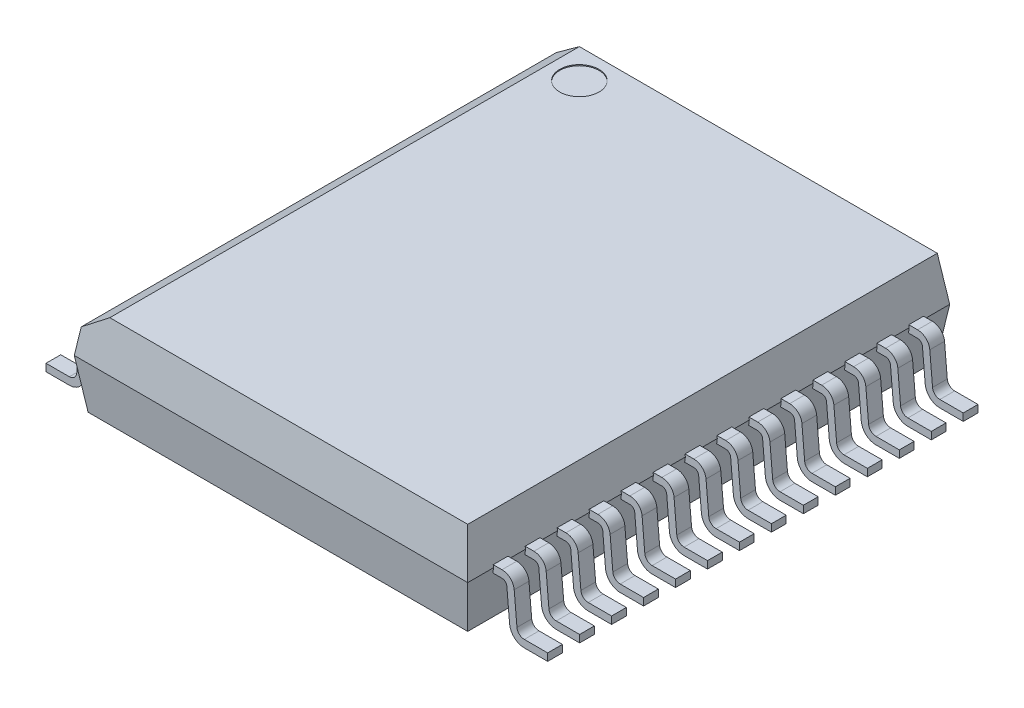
from build123d import *

# Parameters (mm, degrees)
EXTRUDE_1_DEPTH              = 0.15
SKETCH_9815_W                = 8
SKETCH_9815_H                = 9.8
EXTRUDE_9873_DEPTH           = 0.9
EXTRUDE_9873_TAPER           = 8
EXTRUDE_9873_OTHER_WAY_DEPTH = 1
EXTRUDE_9873_OTHER_WAY_TAPER = 8
PATTERN_LINEAR_9952_COUNT    = 14
PATTERN_LINEAR_9952_PITCH    = 0.65
CHAMFER_1_SIZE               = 0.4
CHAMFER_1_SIZE2              = 0.469982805
SKETCH_3_R                   = 0.4
CUT_EXTRUDE_3_DEPTH          = 0.02


with BuildPart() as part:
    # Sketch 1 → Extrude 1 (new, symmetric)
    with BuildSketch(Plane.XY.offset(-4.225)):
        with BuildLine():
            Line((-5.1, 0), (-4.624899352, 0))
            ThreePointArc((-4.624899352, 0), (-4.42222229, 0.078816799), (-4.326040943, 0.273853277))
            Line((-4.326040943, 0.273853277), (-4.270497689, 0.908715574))
            ThreePointArc((-4.270497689, 0.908715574), (-4.23843724, 0.973727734), (-4.170878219, 1))
            Line((-4.170878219, 1), (4.170878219, 1))
            ThreePointArc((4.170878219, 1), (4.23843724, 0.973727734), (4.270497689, 0.908715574))
            Line((4.270497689, 0.908715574), (4.326040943, 0.273853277))
            ThreePointArc((4.326040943, 0.273853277), (4.42222229, 0.078816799), (4.624899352, 0))
            Line((4.624899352, 0), (5.1, 0))
            Line((5.1, 0), (5.1, 0.15))
            Line((5.1, 0.15), (4.624899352, 0.15))
            ThreePointArc((4.624899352, 0.15), (4.523560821, 0.189408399), (4.475470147, 0.286926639))
            Line((4.475470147, 0.286926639), (4.419926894, 0.921788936))
            ThreePointArc((4.419926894, 0.921788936), (4.339775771, 1.084319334), (4.170878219, 1.15))
            Line((4.170878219, 1.15), (-4.170878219, 1.15))
            ThreePointArc((-4.170878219, 1.15), (-4.339775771, 1.084319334), (-4.419926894, 0.921788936))
            Line((-4.419926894, 0.921788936), (-4.475470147, 0.286926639))
            ThreePointArc((-4.475470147, 0.286926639), (-4.523560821, 0.189408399), (-4.624899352, 0.15))
            Line((-4.624899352, 0.15), (-5.1, 0.15))
            Line((-5.1, 0.15), (-5.1, 0))
        make_face()
    extrude_1 = extrude(amount=EXTRUDE_1_DEPTH, both=True)

    # Sketch 9815 → Extrude 9873 (add)
    with BuildSketch(Plane(origin=(0, 1.1, 0), x_dir=(1, 0, 0), z_dir=(0, 1, 0))):
        Rectangle(SKETCH_9815_W, SKETCH_9815_H)
    extrude(amount=EXTRUDE_9873_DEPTH, taper=EXTRUDE_9873_TAPER)

    # Sketch 9815 → Extrude 9873 other way (add)
    with BuildSketch(Plane(origin=(0, 1.1, 0), x_dir=(1, 0, 0), z_dir=(0, 1, 0))):
        Rectangle(SKETCH_9815_W, SKETCH_9815_H)
    extrude(amount=-EXTRUDE_9873_OTHER_WAY_DEPTH, taper=EXTRUDE_9873_OTHER_WAY_TAPER)

    # Pattern Linear 9952: Extrude 1 ×14
    with Locations(*[(0, 0, i * PATTERN_LINEAR_9952_PITCH) for i in range(1, PATTERN_LINEAR_9952_COUNT)]):
        add(extrude_1)

    # Chamfer 1
    chamfer_1_edges = [part.edges().sort_by_distance(p)[0] for p in [
        (-3.873513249, 2, 0),
    ]]
    chamfer_1_side = [part.faces().sort_by_distance(p)[0] for p in [
        (-3.93556274, 1.558494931, 0),
    ]]
    chamfer(chamfer_1_edges, length=CHAMFER_1_SIZE, length2=CHAMFER_1_SIZE2, reference=chamfer_1_side[0])

    # Sketch 3 → Cut-Extrude 3 (cut)
    with BuildSketch(Plane(origin=(0, 2, 0), x_dir=(1, 0, 0), z_dir=(0, 1, 0))):
        with Locations(Location((-2.803530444, 4.173513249, 0), (0, 0, 270))):
            Circle(SKETCH_3_R)
    extrude(amount=-CUT_EXTRUDE_3_DEPTH, mode=Mode.SUBTRACT)


solid = part.part
